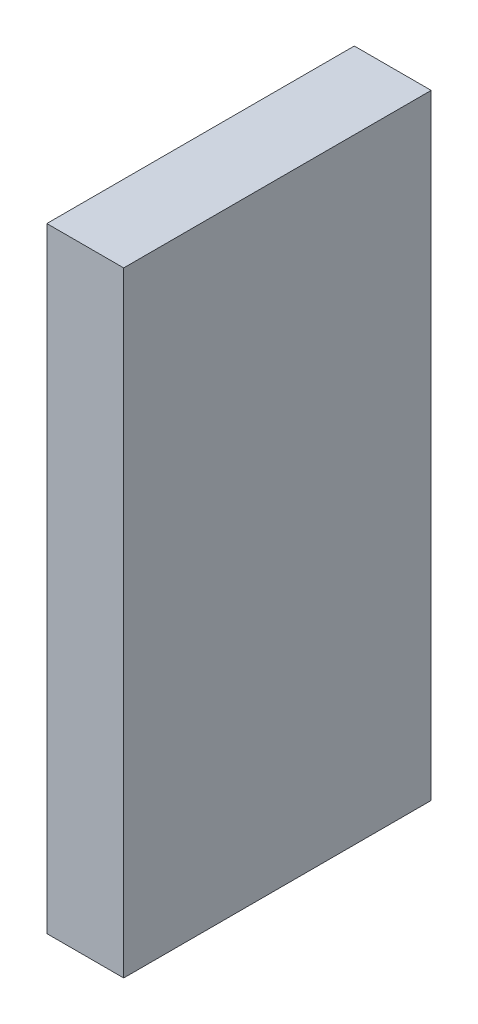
from build123d import *

# Parameters (mm, degrees)
SKETCH1_W      = 2.5
SKETCH1_H      = 20
EXTRUDE1_DEPTH = 10


with BuildPart() as part:
    # Sketch1 → Extrude1 (new body)
    with BuildSketch(Plane.XY):
        with Locations((15.771696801, 17.733936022)):
            Rectangle(SKETCH1_W, SKETCH1_H)
    extrude(amount=-EXTRUDE1_DEPTH)


solid = part.part
